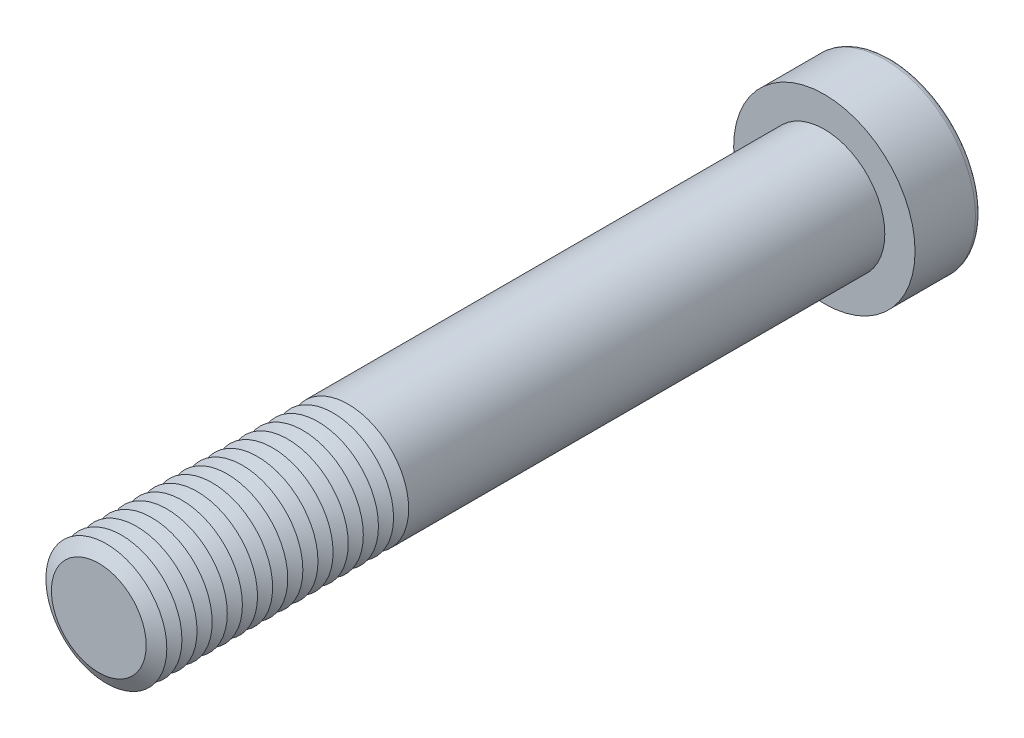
from build123d import *

# Parameters (mm, degrees)
SKETCH1_R           = 10
BOSS_EXTRUDE1_DEPTH = 120
SKETCH2_R           = 15
BOSS_EXTRUDE2_DEPTH = 11
CUT_EXTRUDE1_DEPTH  = 10.5
FILLET1_R           = 1
LPATTERN1_COUNT     = 17
LPATTERN1_PITCH     = 2.5


with BuildPart() as part:
    # Sketch1 → Boss-Extrude1 (new body)
    with BuildSketch(Plane.XY):
        Circle(SKETCH1_R)
    extrude(amount=BOSS_EXTRUDE1_DEPTH)

    # Sketch2 → Boss-Extrude2 (add)
    with BuildSketch(Plane(origin=(0, 0, 0), x_dir=(-1, 0, 0), z_dir=(0, 0, -1))):
        Circle(SKETCH2_R)
    extrude(amount=BOSS_EXTRUDE2_DEPTH)

    # Sketch3 → Cut-Extrude1 (cut)
    with BuildSketch(Plane(origin=(0, 0, -11), x_dir=(-1, 0, 0), z_dir=(0, 0, -1))):
        Polygon((-4.041451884, 7), (-8.082903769, 0), (-4.041451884, -7), (4.041451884, -7), (8.082903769, 0), (4.041451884, 7), align=None)
    extrude(amount=-CUT_EXTRUDE1_DEPTH, mode=Mode.SUBTRACT)

    # Fillet1
    fillet1_edges = [part.edges().sort_by_distance(p)[0] for p in [
        (15, 0, -11),
    ]]
    fillet(fillet1_edges, radius=FILLET1_R)

    # Cut-Extrude2 cone 1 section (on through the dimple's axis) → Cut-Extrude2 (revolve, cut)
    with BuildSketch(Plane(origin=(0, 0, -0.5), x_dir=(0, 1, 0), z_dir=(1, 0, 0))):
        Polygon((0, 0), (7, 0), (0, 4.041451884), align=None)
    revolve(axis=Axis((0, 0, -0.5), (0, 0, 1)), mode=Mode.SUBTRACT)

    # Cut-Extrude3 cone 1 section (on through the dimple's axis) → Cut-Extrude3 (revolve, cut)
    with BuildSketch(Plane(origin=(0, 0, -11), x_dir=(0, 1, 0), z_dir=(1, 0, 0))):
        Polygon((0, 0), (8.082903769, 0), (0, 2.165807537), align=None)
    revolve(axis=Axis((0, 0, -11), (0, 0, 1)), mode=Mode.SUBTRACT)

    # Sketch7 → Cut-Revolve1 (revolve, cut)
    with BuildSketch(Plane(origin=(0, 0, 0), x_dir=(0, 0, -1), z_dir=(1, 0, 0)), mode=Mode.PRIVATE) as cut_revolve1_sk:
        Polygon((-120, 7.834936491), (-118.75, 10), (-121.25, 10), align=None)
    cut_revolve1 = revolve(cut_revolve1_sk.sketch.rotate(Axis((0, 0, 120), (0, 0, -1)), 90), axis=Axis((0, 0, 120), (0, 0, -1)), mode=Mode.SUBTRACT)

    # LPattern1: Cut-Revolve1 ×17
    with Locations(*[(0, 0, -i * LPATTERN1_PITCH) for i in range(1, LPATTERN1_COUNT)]):
        add(cut_revolve1, mode=Mode.SUBTRACT)


solid = part.part
